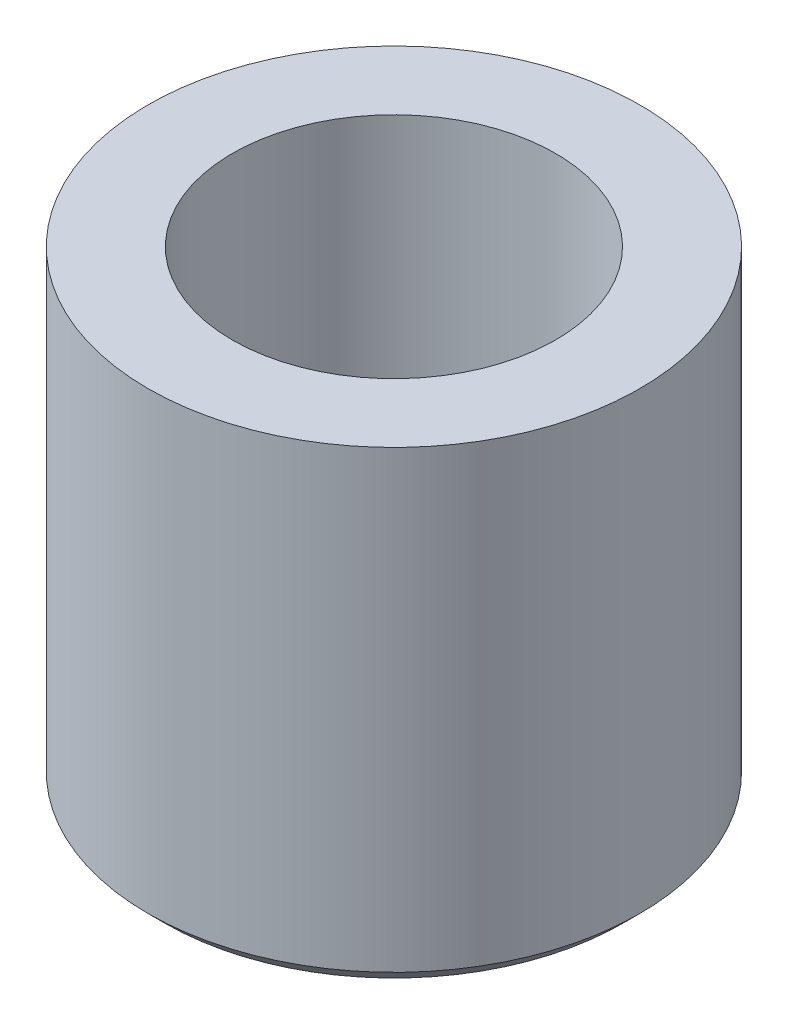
ISO-10303-21;
HEADER;
FILE_DESCRIPTION(('STEP AP214'),'2;1');
FILE_NAME('part.step','',(''),(''),'','','');
FILE_SCHEMA(('AUTOMOTIVE_DESIGN { 1 0 10303 214 1 1 1 1 }'));
ENDSEC;
DATA;
#1=APPLICATION_CONTEXT('core data for automotive mechanical design processes');
#2=APPLICATION_PROTOCOL_DEFINITION('international standard','automotive_design',2000,#1);
#3=PRODUCT_CONTEXT('',#1,'mechanical');
#4=PRODUCT('Part','Part','',(#3));
#5=PRODUCT_RELATED_PRODUCT_CATEGORY('part','',(#4));
#6=PRODUCT_DEFINITION_FORMATION('','',#4);
#7=PRODUCT_DEFINITION_CONTEXT('part definition',#1,'design');
#8=PRODUCT_DEFINITION('design','',#6,#7);
#9=PRODUCT_DEFINITION_SHAPE('','',#8);
#10=(LENGTH_UNIT() NAMED_UNIT(*) SI_UNIT(.MILLI.,.METRE.));
#11=(NAMED_UNIT(*) PLANE_ANGLE_UNIT() SI_UNIT($,.RADIAN.));
#12=(NAMED_UNIT(*) SI_UNIT($,.STERADIAN.) SOLID_ANGLE_UNIT());
#13=UNCERTAINTY_MEASURE_WITH_UNIT(LENGTH_MEASURE(1.E-05),#10,'distance_accuracy_value','');
#14=(GEOMETRIC_REPRESENTATION_CONTEXT(3) GLOBAL_UNCERTAINTY_ASSIGNED_CONTEXT((#13)) GLOBAL_UNIT_ASSIGNED_CONTEXT((#10,
#11,#12)) REPRESENTATION_CONTEXT('',''));
#15=CARTESIAN_POINT('',(0.,0.,0.));
#16=DIRECTION('',(0.,0.,1.));
#17=DIRECTION('',(1.,0.,0.));
#18=AXIS2_PLACEMENT_3D('',#15,#16,#17);
#19=CARTESIAN_POINT('',(0.,7.,0.));
#20=DIRECTION('',(0.,1.,0.));
#21=DIRECTION('',(0.,0.,1.));
#22=AXIS2_PLACEMENT_3D('',#19,#20,#21);
#23=PLANE('',#22);
#24=CARTESIAN_POINT('',(0.,7.,0.));
#25=DIRECTION('',(0.,1.,0.));
#26=DIRECTION('',(0.,0.,1.));
#27=AXIS2_PLACEMENT_3D('',#24,#25,#26);
#28=CIRCLE('',#27,3.65);
#29=CARTESIAN_POINT('',(0.,7.,3.65));
#30=VERTEX_POINT('',#29);
#31=EDGE_CURVE('E58',#30,#30,#28,.T.);
#32=ORIENTED_EDGE('',*,*,#31,.T.);
#33=EDGE_LOOP('',(#32));
#34=FACE_BOUND('',#33,.T.);
#35=CARTESIAN_POINT('',(0.,7.,0.));
#36=DIRECTION('',(0.,1.,0.));
#37=DIRECTION('',(0.,0.,1.));
#38=AXIS2_PLACEMENT_3D('',#35,#36,#37);
#39=CIRCLE('',#38,2.4);
#40=CARTESIAN_POINT('',(0.,7.,2.4));
#41=VERTEX_POINT('',#40);
#42=EDGE_CURVE('E61',#41,#41,#39,.T.);
#43=ORIENTED_EDGE('',*,*,#42,.F.);
#44=EDGE_LOOP('',(#43));
#45=FACE_BOUND('',#44,.T.);
#46=ADVANCED_FACE('F37',(#34,#45),#23,.T.);
#47=CARTESIAN_POINT('',(0.,0.,0.));
#48=DIRECTION('',(0.,1.,0.));
#49=DIRECTION('',(0.,0.,1.));
#50=AXIS2_PLACEMENT_3D('',#47,#48,#49);
#51=PLANE('',#50);
#52=CARTESIAN_POINT('',(0.,0.,0.));
#53=DIRECTION('',(0.,1.,0.));
#54=DIRECTION('',(0.,0.,1.));
#55=AXIS2_PLACEMENT_3D('',#52,#53,#54);
#56=CIRCLE('',#55,3.4);
#57=CARTESIAN_POINT('',(0.,0.,3.4));
#58=VERTEX_POINT('',#57);
#59=EDGE_CURVE('E45',#58,#58,#56,.F.);
#60=ORIENTED_EDGE('',*,*,#59,.T.);
#61=EDGE_LOOP('',(#60));
#62=FACE_BOUND('',#61,.T.);
#63=CARTESIAN_POINT('',(0.,0.,0.));
#64=DIRECTION('',(0.,1.,0.));
#65=DIRECTION('',(0.,0.,1.));
#66=AXIS2_PLACEMENT_3D('',#63,#64,#65);
#67=CIRCLE('',#66,2.65);
#68=CARTESIAN_POINT('',(0.,0.,2.65));
#69=VERTEX_POINT('',#68);
#70=EDGE_CURVE('E49',#69,#69,#67,.T.);
#71=ORIENTED_EDGE('',*,*,#70,.T.);
#72=EDGE_LOOP('',(#71));
#73=FACE_BOUND('',#72,.T.);
#74=ADVANCED_FACE('F68',(#62,#73),#51,.F.);
#75=CARTESIAN_POINT('',(0.,7.,0.));
#76=DIRECTION('',(0.,-1.,0.));
#77=DIRECTION('',(0.,0.,-1.));
#78=AXIS2_PLACEMENT_3D('',#75,#76,#77);
#79=CYLINDRICAL_SURFACE('',#78,3.65);
#80=CARTESIAN_POINT('',(0.,0.250000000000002,0.));
#81=DIRECTION('',(0.,1.,0.));
#82=DIRECTION('',(0.,0.,1.));
#83=AXIS2_PLACEMENT_3D('',#80,#81,#82);
#84=CIRCLE('',#83,3.65);
#85=CARTESIAN_POINT('',(0.,0.250000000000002,3.65));
#86=VERTEX_POINT('',#85);
#87=EDGE_CURVE('E53',#86,#86,#84,.T.);
#88=ORIENTED_EDGE('',*,*,#87,.T.);
#89=EDGE_LOOP('',(#88));
#90=FACE_BOUND('',#89,.T.);
#91=ORIENTED_EDGE('',*,*,#31,.F.);
#92=EDGE_LOOP('',(#91));
#93=FACE_BOUND('',#92,.T.);
#94=ADVANCED_FACE('F74',(#90,#93),#79,.T.);
#95=CARTESIAN_POINT('',(0.,7.,0.));
#96=DIRECTION('',(0.,-1.,0.));
#97=DIRECTION('',(0.,0.,-1.));
#98=AXIS2_PLACEMENT_3D('',#95,#96,#97);
#99=CYLINDRICAL_SURFACE('',#98,2.4);
#100=CARTESIAN_POINT('',(0.,0.250000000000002,0.));
#101=DIRECTION('',(0.,1.,0.));
#102=DIRECTION('',(0.,0.,1.));
#103=AXIS2_PLACEMENT_3D('',#100,#101,#102);
#104=CIRCLE('',#103,2.4);
#105=CARTESIAN_POINT('',(0.,0.250000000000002,2.4));
#106=VERTEX_POINT('',#105);
#107=EDGE_CURVE('E10',#106,#106,#104,.F.);
#108=ORIENTED_EDGE('',*,*,#107,.T.);
#109=EDGE_LOOP('',(#108));
#110=FACE_BOUND('',#109,.T.);
#111=ORIENTED_EDGE('',*,*,#42,.T.);
#112=EDGE_LOOP('',(#111));
#113=FACE_BOUND('',#112,.T.);
#114=ADVANCED_FACE('F65',(#110,#113),#99,.F.);
#115=CARTESIAN_POINT('',(0.,0.250000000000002,0.));
#116=DIRECTION('',(0.,1.,0.));
#117=DIRECTION('',(0.,0.,1.));
#118=AXIS2_PLACEMENT_3D('',#115,#116,#117);
#119=CONICAL_SURFACE('',#118,3.65,0.785398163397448);
#120=ORIENTED_EDGE('',*,*,#59,.F.);
#121=EDGE_LOOP('',(#120));
#122=FACE_BOUND('',#121,.T.);
#123=ORIENTED_EDGE('',*,*,#87,.F.);
#124=EDGE_LOOP('',(#123));
#125=FACE_BOUND('',#124,.T.);
#126=ADVANCED_FACE('F81',(#122,#125),#119,.T.);
#127=CARTESIAN_POINT('',(0.,0.,0.));
#128=DIRECTION('',(0.,-1.,0.));
#129=DIRECTION('',(0.,0.,-1.));
#130=AXIS2_PLACEMENT_3D('',#127,#128,#129);
#131=CONICAL_SURFACE('',#130,2.65,0.785398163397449);
#132=ORIENTED_EDGE('',*,*,#107,.F.);
#133=EDGE_LOOP('',(#132));
#134=FACE_BOUND('',#133,.T.);
#135=ORIENTED_EDGE('',*,*,#70,.F.);
#136=EDGE_LOOP('',(#135));
#137=FACE_BOUND('',#136,.T.);
#138=ADVANCED_FACE('F40',(#134,#137),#131,.F.);
#139=CLOSED_SHELL('',(#46,#74,#94,#114,#126,#138));
#140=MANIFOLD_SOLID_BREP('B2',#139);
#141=ADVANCED_BREP_SHAPE_REPRESENTATION('',(#18,#140),#14);
#142=SHAPE_DEFINITION_REPRESENTATION(#9,#141);
ENDSEC;
END-ISO-10303-21;
